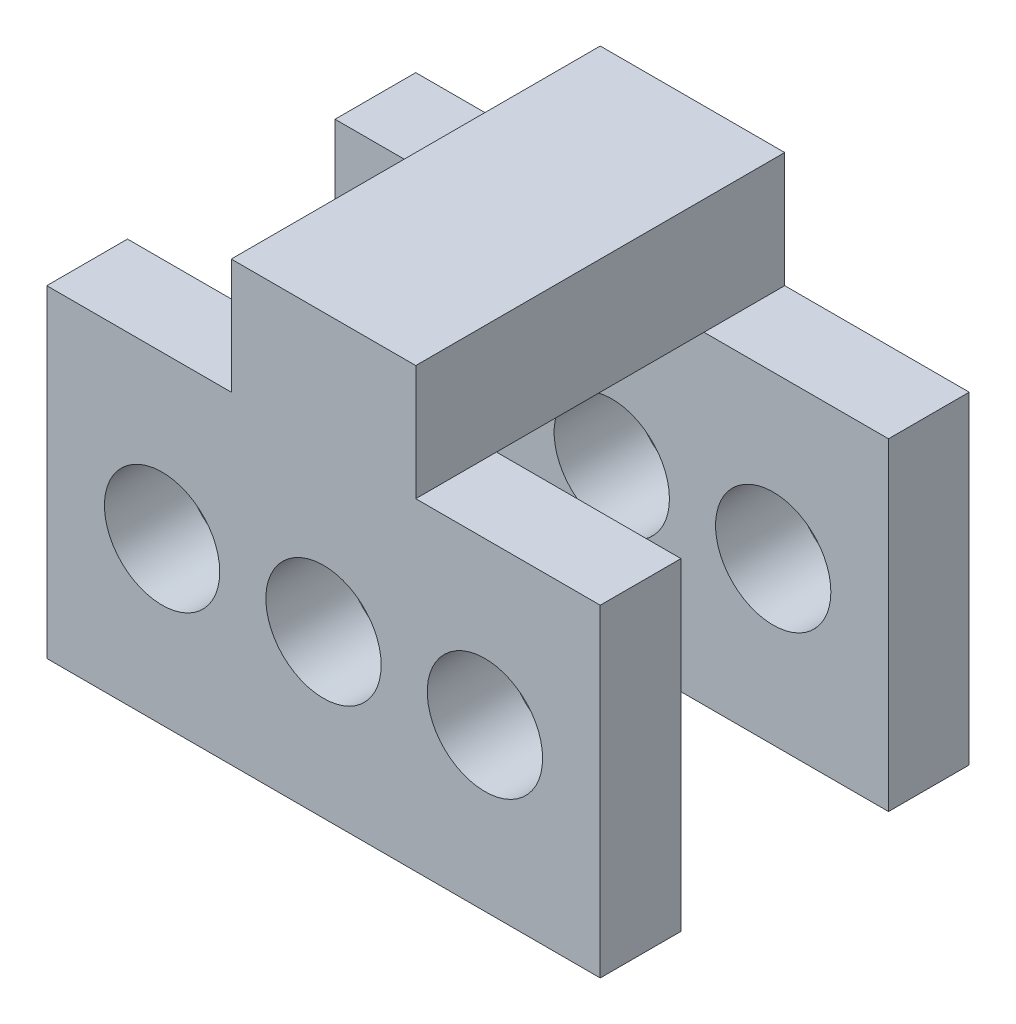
from build123d import *

# Parameters (mm, degrees)
SKETCH_2_W      = 32
SKETCH_2_H      = 20
EXTRUDE_1_DEPTH = 32
SKETCH_3_W      = 96
SKETCH_3_H      = 56
SKETCH_3_R      = 10
EXTRUDE_2_DEPTH = 14


with BuildPart() as part:
    # Sketch 2 → Extrude 1 (new, symmetric)
    with BuildSketch(Plane.XY):
        with Locations((0, 38)):
            Rectangle(SKETCH_2_W, SKETCH_2_H)
    extrude(amount=EXTRUDE_1_DEPTH, both=True)

    # Sketch 3 → Extrude 2 (add)
    with BuildSketch(Plane.XY.offset(32)):
        Rectangle(SKETCH_3_W, SKETCH_3_H)
        Circle(SKETCH_3_R, mode=Mode.SUBTRACT)
        with Locations((-28, 0)):
            Circle(SKETCH_3_R, mode=Mode.SUBTRACT)
        with Locations((28, 0)):
            Circle(SKETCH_3_R, mode=Mode.SUBTRACT)
    extrude_2 = extrude(amount=-EXTRUDE_2_DEPTH)

    # Mirror 1: Extrude 2 across plane
    add(extrude_2.mirror(Plane.XY))


solid = part.part
